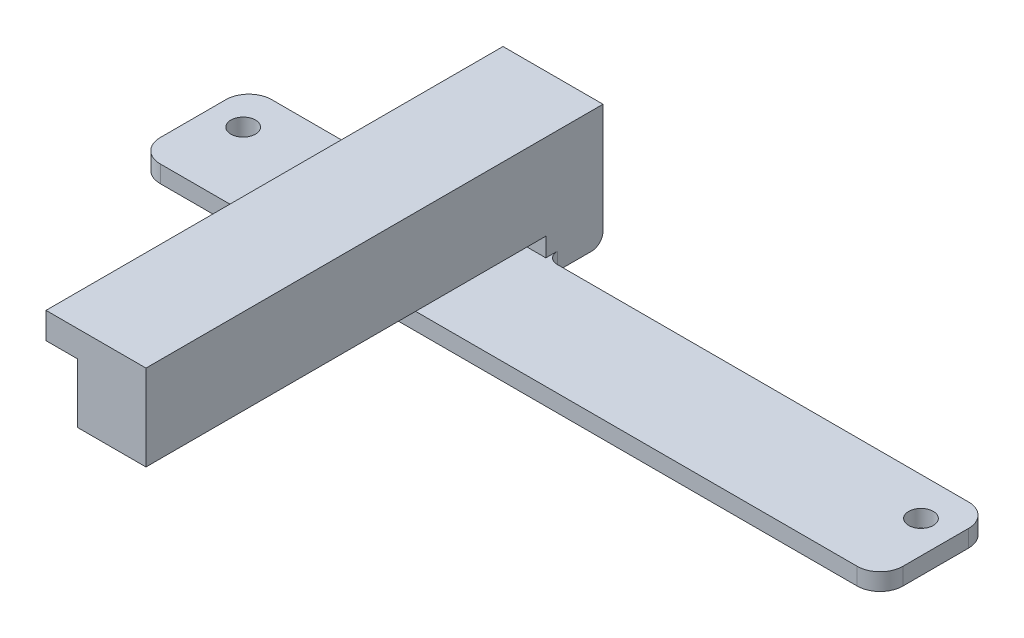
ISO-10303-21;
HEADER;
FILE_DESCRIPTION(('STEP AP214'),'2;1');
FILE_NAME('part.step','',(''),(''),'','','');
FILE_SCHEMA(('AUTOMOTIVE_DESIGN { 1 0 10303 214 1 1 1 1 }'));
ENDSEC;
DATA;
#1=APPLICATION_CONTEXT('core data for automotive mechanical design processes');
#2=APPLICATION_PROTOCOL_DEFINITION('international standard','automotive_design',2000,#1);
#3=PRODUCT_CONTEXT('',#1,'mechanical');
#4=PRODUCT('Part','Part','',(#3));
#5=PRODUCT_RELATED_PRODUCT_CATEGORY('part','',(#4));
#6=PRODUCT_DEFINITION_FORMATION('','',#4);
#7=PRODUCT_DEFINITION_CONTEXT('part definition',#1,'design');
#8=PRODUCT_DEFINITION('design','',#6,#7);
#9=PRODUCT_DEFINITION_SHAPE('','',#8);
#10=(LENGTH_UNIT() NAMED_UNIT(*) SI_UNIT(.MILLI.,.METRE.));
#11=(NAMED_UNIT(*) PLANE_ANGLE_UNIT() SI_UNIT($,.RADIAN.));
#12=(NAMED_UNIT(*) SI_UNIT($,.STERADIAN.) SOLID_ANGLE_UNIT());
#13=UNCERTAINTY_MEASURE_WITH_UNIT(LENGTH_MEASURE(1.E-05),#10,'distance_accuracy_value','');
#14=(GEOMETRIC_REPRESENTATION_CONTEXT(3) GLOBAL_UNCERTAINTY_ASSIGNED_CONTEXT((#13)) GLOBAL_UNIT_ASSIGNED_CONTEXT((#10,
#11,#12)) REPRESENTATION_CONTEXT('',''));
#15=CARTESIAN_POINT('',(0.,0.,0.));
#16=DIRECTION('',(0.,0.,1.));
#17=DIRECTION('',(1.,0.,0.));
#18=AXIS2_PLACEMENT_3D('',#15,#16,#17);
#19=CARTESIAN_POINT('',(-30.5,-20.1556443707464,-9.75));
#20=DIRECTION('',(0.,0.,1.));
#21=DIRECTION('',(1.,0.,0.));
#22=AXIS2_PLACEMENT_3D('',#19,#20,#21);
#23=PLANE('',#22);
#24=DIRECTION('',(0.,1.,0.));
#25=VECTOR('',#24,1.);
#26=CARTESIAN_POINT('',(-13.,-20.1556443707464,-9.75));
#27=LINE('',#26,#25);
#28=CARTESIAN_POINT('',(-13.,3.,-9.75));
#29=VERTEX_POINT('',#28);
#30=CARTESIAN_POINT('',(-13.,6.3,-9.75));
#31=VERTEX_POINT('',#30);
#32=EDGE_CURVE('E258',#29,#31,#27,.T.);
#33=ORIENTED_EDGE('',*,*,#32,.T.);
#34=DIRECTION('',(1.,0.,0.));
#35=VECTOR('',#34,1.);
#36=CARTESIAN_POINT('',(-13.,6.3,-9.75));
#37=LINE('',#36,#35);
#38=CARTESIAN_POINT('',(-25.,6.3,-9.75));
#39=VERTEX_POINT('',#38);
#40=EDGE_CURVE('E208',#39,#31,#37,.T.);
#41=ORIENTED_EDGE('',*,*,#40,.F.);
#42=DIRECTION('',(1.,0.,0.));
#43=VECTOR('',#42,1.);
#44=CARTESIAN_POINT('',(-30.5,6.3,-9.75));
#45=LINE('',#44,#43);
#46=CARTESIAN_POINT('',(-30.5,6.3,-9.75));
#47=VERTEX_POINT('',#46);
#48=EDGE_CURVE('E223',#47,#39,#45,.T.);
#49=ORIENTED_EDGE('',*,*,#48,.F.);
#50=DIRECTION('',(0.,1.,0.));
#51=VECTOR('',#50,1.);
#52=CARTESIAN_POINT('',(-30.5,-20.1556443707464,-9.75));
#53=LINE('',#52,#51);
#54=CARTESIAN_POINT('',(-30.5,3.,-9.75));
#55=VERTEX_POINT('',#54);
#56=EDGE_CURVE('E261',#55,#47,#53,.T.);
#57=ORIENTED_EDGE('',*,*,#56,.F.);
#58=DIRECTION('',(-1.,0.,0.));
#59=VECTOR('',#58,1.);
#60=CARTESIAN_POINT('',(0.,3.,-9.75));
#61=LINE('',#60,#59);
#62=EDGE_CURVE('E275',#29,#55,#61,.T.);
#63=ORIENTED_EDGE('',*,*,#62,.F.);
#64=EDGE_LOOP('',(#33,#41,#49,#57,#63));
#65=FACE_BOUND('',#64,.T.);
#66=ADVANCED_FACE('F39',(#65),#23,.T.);
#67=CARTESIAN_POINT('',(-30.5,-20.1556443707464,-9.75));
#68=DIRECTION('',(-1.,0.,0.));
#69=DIRECTION('',(0.,0.,1.));
#70=AXIS2_PLACEMENT_3D('',#67,#68,#69);
#71=PLANE('',#70);
#72=DIRECTION('',(0.,0.,1.));
#73=VECTOR('',#72,1.);
#74=CARTESIAN_POINT('',(-30.5,6.3,-31.5147779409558));
#75=LINE('',#74,#73);
#76=CARTESIAN_POINT('',(-30.5,6.3,-19.75));
#77=VERTEX_POINT('',#76);
#78=EDGE_CURVE('E191',#77,#47,#75,.T.);
#79=ORIENTED_EDGE('',*,*,#78,.F.);
#80=DIRECTION('',(0.,1.,0.));
#81=VECTOR('',#80,1.);
#82=CARTESIAN_POINT('',(-30.5,-20.1556443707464,-19.75));
#83=LINE('',#82,#81);
#84=CARTESIAN_POINT('',(-30.5,2.,-19.75));
#85=VERTEX_POINT('',#84);
#86=EDGE_CURVE('E262',#85,#77,#83,.T.);
#87=ORIENTED_EDGE('',*,*,#86,.F.);
#88=CARTESIAN_POINT('',(-30.5,2.,-17.75));
#89=DIRECTION('',(-1.,0.,0.));
#90=DIRECTION('',(0.,0.,1.));
#91=AXIS2_PLACEMENT_3D('',#88,#89,#90);
#92=CIRCLE('',#91,2.);
#93=CARTESIAN_POINT('',(-30.5,0.,-17.75));
#94=VERTEX_POINT('',#93);
#95=EDGE_CURVE('E344',#85,#94,#92,.T.);
#96=ORIENTED_EDGE('',*,*,#95,.T.);
#97=DIRECTION('',(0.,0.,1.));
#98=VECTOR('',#97,1.);
#99=CARTESIAN_POINT('',(-30.5,0.,-9.75));
#100=LINE('',#99,#98);
#101=CARTESIAN_POINT('',(-30.5,0.,-9.75));
#102=VERTEX_POINT('',#101);
#103=EDGE_CURVE('E259',#94,#102,#100,.T.);
#104=ORIENTED_EDGE('',*,*,#103,.T.);
#105=EDGE_CURVE('E272',#102,#55,#53,.T.);
#106=ORIENTED_EDGE('',*,*,#105,.T.);
#107=ORIENTED_EDGE('',*,*,#56,.T.);
#108=EDGE_LOOP('',(#79,#87,#96,#104,#106,#107));
#109=FACE_BOUND('',#108,.T.);
#110=ADVANCED_FACE('F407',(#109),#71,.T.);
#111=CARTESIAN_POINT('',(-65.,3.,-9.75));
#112=DIRECTION('',(0.,0.,1.));
#113=DIRECTION('',(1.,0.,0.));
#114=AXIS2_PLACEMENT_3D('',#111,#112,#113);
#115=PLANE('',#114);
#116=DIRECTION('',(-1.,0.,0.));
#117=VECTOR('',#116,1.);
#118=CARTESIAN_POINT('',(-65.,0.,-9.75));
#119=LINE('',#118,#117);
#120=CARTESIAN_POINT('',(61.,0.,-9.75));
#121=VERTEX_POINT('',#120);
#122=CARTESIAN_POINT('',(-11.,0.,-9.75));
#123=VERTEX_POINT('',#122);
#124=EDGE_CURVE('E296',#121,#123,#119,.T.);
#125=ORIENTED_EDGE('',*,*,#124,.T.);
#126=DIRECTION('',(0.,1.,0.));
#127=VECTOR('',#126,1.);
#128=CARTESIAN_POINT('',(-11.,3.,-9.75));
#129=LINE('',#128,#127);
#130=CARTESIAN_POINT('',(-11.,3.,-9.75));
#131=VERTEX_POINT('',#130);
#132=EDGE_CURVE('E353',#123,#131,#129,.T.);
#133=ORIENTED_EDGE('',*,*,#132,.T.);
#134=DIRECTION('',(-1.,0.,0.));
#135=VECTOR('',#134,1.);
#136=CARTESIAN_POINT('',(-65.,3.,-9.75));
#137=LINE('',#136,#135);
#138=CARTESIAN_POINT('',(61.,3.,-9.75));
#139=VERTEX_POINT('',#138);
#140=EDGE_CURVE('E283',#139,#131,#137,.T.);
#141=ORIENTED_EDGE('',*,*,#140,.F.);
#142=DIRECTION('',(0.,-1.,0.));
#143=VECTOR('',#142,1.);
#144=CARTESIAN_POINT('',(61.,3.,-9.75));
#145=LINE('',#144,#143);
#146=EDGE_CURVE('E335',#139,#121,#145,.T.);
#147=ORIENTED_EDGE('',*,*,#146,.T.);
#148=EDGE_LOOP('',(#125,#133,#141,#147));
#149=FACE_BOUND('',#148,.T.);
#150=ADVANCED_FACE('F366',(#149),#115,.F.);
#151=CARTESIAN_POINT('',(65.,3.,9.75));
#152=DIRECTION('',(-1.,0.,0.));
#153=DIRECTION('',(0.,0.,1.));
#154=AXIS2_PLACEMENT_3D('',#151,#152,#153);
#155=PLANE('',#154);
#156=DIRECTION('',(0.,0.,-1.));
#157=VECTOR('',#156,1.);
#158=CARTESIAN_POINT('',(65.,3.,9.75));
#159=LINE('',#158,#157);
#160=CARTESIAN_POINT('',(65.,3.,5.75));
#161=VERTEX_POINT('',#160);
#162=CARTESIAN_POINT('',(65.,3.,-5.75));
#163=VERTEX_POINT('',#162);
#164=EDGE_CURVE('E278',#161,#163,#159,.T.);
#165=ORIENTED_EDGE('',*,*,#164,.F.);
#166=DIRECTION('',(0.,-1.,0.));
#167=VECTOR('',#166,1.);
#168=CARTESIAN_POINT('',(65.,3.,5.75));
#169=LINE('',#168,#167);
#170=CARTESIAN_POINT('',(65.,0.,5.75));
#171=VERTEX_POINT('',#170);
#172=EDGE_CURVE('E305',#161,#171,#169,.T.);
#173=ORIENTED_EDGE('',*,*,#172,.T.);
#174=DIRECTION('',(0.,0.,-1.));
#175=VECTOR('',#174,1.);
#176=CARTESIAN_POINT('',(65.,0.,9.75));
#177=LINE('',#176,#175);
#178=CARTESIAN_POINT('',(65.,0.,-5.75));
#179=VERTEX_POINT('',#178);
#180=EDGE_CURVE('E277',#171,#179,#177,.T.);
#181=ORIENTED_EDGE('',*,*,#180,.T.);
#182=DIRECTION('',(0.,-1.,0.));
#183=VECTOR('',#182,1.);
#184=CARTESIAN_POINT('',(65.,3.,-5.75));
#185=LINE('',#184,#183);
#186=EDGE_CURVE('E292',#179,#163,#185,.F.);
#187=ORIENTED_EDGE('',*,*,#186,.T.);
#188=EDGE_LOOP('',(#165,#173,#181,#187));
#189=FACE_BOUND('',#188,.T.);
#190=ADVANCED_FACE('F375',(#189),#155,.F.);
#191=CARTESIAN_POINT('',(-61.,3.,-9.75));
#192=VERTEX_POINT('',#191);
#193=EDGE_CURVE('E281',#55,#192,#137,.T.);
#194=ORIENTED_EDGE('',*,*,#193,.F.);
#195=ORIENTED_EDGE('',*,*,#105,.F.);
#196=CARTESIAN_POINT('',(-61.,0.,-9.75));
#197=VERTEX_POINT('',#196);
#198=EDGE_CURVE('E295',#102,#197,#119,.T.);
#199=ORIENTED_EDGE('',*,*,#198,.T.);
#200=DIRECTION('',(0.,-1.,0.));
#201=VECTOR('',#200,1.);
#202=CARTESIAN_POINT('',(-61.,3.,-9.75));
#203=LINE('',#202,#201);
#204=EDGE_CURVE('E338',#197,#192,#203,.F.);
#205=ORIENTED_EDGE('',*,*,#204,.T.);
#206=EDGE_LOOP('',(#194,#195,#199,#205));
#207=FACE_BOUND('',#206,.T.);
#208=ADVANCED_FACE('F403',(#207),#115,.F.);
#209=CARTESIAN_POINT('',(-65.,3.,9.75));
#210=DIRECTION('',(1.,0.,0.));
#211=DIRECTION('',(0.,0.,-1.));
#212=AXIS2_PLACEMENT_3D('',#209,#210,#211);
#213=PLANE('',#212);
#214=DIRECTION('',(0.,0.,1.));
#215=VECTOR('',#214,1.);
#216=CARTESIAN_POINT('',(-65.,0.,9.75));
#217=LINE('',#216,#215);
#218=CARTESIAN_POINT('',(-65.,0.,-5.75));
#219=VERTEX_POINT('',#218);
#220=CARTESIAN_POINT('',(-65.,0.,5.75));
#221=VERTEX_POINT('',#220);
#222=EDGE_CURVE('E299',#219,#221,#217,.T.);
#223=ORIENTED_EDGE('',*,*,#222,.T.);
#224=DIRECTION('',(0.,-1.,0.));
#225=VECTOR('',#224,1.);
#226=CARTESIAN_POINT('',(-65.,3.,5.75));
#227=LINE('',#226,#225);
#228=CARTESIAN_POINT('',(-65.,3.,5.75));
#229=VERTEX_POINT('',#228);
#230=EDGE_CURVE('E333',#221,#229,#227,.F.);
#231=ORIENTED_EDGE('',*,*,#230,.T.);
#232=DIRECTION('',(0.,0.,1.));
#233=VECTOR('',#232,1.);
#234=CARTESIAN_POINT('',(-65.,3.,9.75));
#235=LINE('',#234,#233);
#236=CARTESIAN_POINT('',(-65.,3.,-5.75));
#237=VERTEX_POINT('',#236);
#238=EDGE_CURVE('E286',#237,#229,#235,.T.);
#239=ORIENTED_EDGE('',*,*,#238,.F.);
#240=DIRECTION('',(0.,-1.,0.));
#241=VECTOR('',#240,1.);
#242=CARTESIAN_POINT('',(-65.,3.,-5.75));
#243=LINE('',#242,#241);
#244=EDGE_CURVE('E330',#237,#219,#243,.T.);
#245=ORIENTED_EDGE('',*,*,#244,.T.);
#246=EDGE_LOOP('',(#223,#231,#239,#245));
#247=FACE_BOUND('',#246,.T.);
#248=ADVANCED_FACE('F392',(#247),#213,.F.);
#249=CARTESIAN_POINT('',(-65.,3.,9.75));
#250=DIRECTION('',(0.,0.,-1.));
#251=DIRECTION('',(-1.,0.,0.));
#252=AXIS2_PLACEMENT_3D('',#249,#250,#251);
#253=PLANE('',#252);
#254=DIRECTION('',(1.,0.,0.));
#255=VECTOR('',#254,1.);
#256=CARTESIAN_POINT('',(-65.,0.,9.75));
#257=LINE('',#256,#255);
#258=CARTESIAN_POINT('',(-61.,0.,9.75));
#259=VERTEX_POINT('',#258);
#260=CARTESIAN_POINT('',(61.,0.,9.75));
#261=VERTEX_POINT('',#260);
#262=EDGE_CURVE('E282',#259,#261,#257,.T.);
#263=ORIENTED_EDGE('',*,*,#262,.T.);
#264=DIRECTION('',(0.,-1.,0.));
#265=VECTOR('',#264,1.);
#266=CARTESIAN_POINT('',(61.,3.,9.75));
#267=LINE('',#266,#265);
#268=CARTESIAN_POINT('',(61.,3.,9.75));
#269=VERTEX_POINT('',#268);
#270=EDGE_CURVE('E320',#261,#269,#267,.F.);
#271=ORIENTED_EDGE('',*,*,#270,.T.);
#272=DIRECTION('',(1.,0.,0.));
#273=VECTOR('',#272,1.);
#274=CARTESIAN_POINT('',(-65.,3.,9.75));
#275=LINE('',#274,#273);
#276=CARTESIAN_POINT('',(-61.,3.,9.75));
#277=VERTEX_POINT('',#276);
#278=EDGE_CURVE('E289',#277,#269,#275,.T.);
#279=ORIENTED_EDGE('',*,*,#278,.F.);
#280=DIRECTION('',(0.,-1.,0.));
#281=VECTOR('',#280,1.);
#282=CARTESIAN_POINT('',(-61.,3.,9.75));
#283=LINE('',#282,#281);
#284=EDGE_CURVE('E317',#277,#259,#283,.T.);
#285=ORIENTED_EDGE('',*,*,#284,.T.);
#286=EDGE_LOOP('',(#263,#271,#279,#285));
#287=FACE_BOUND('',#286,.T.);
#288=ADVANCED_FACE('F383',(#287),#253,.F.);
#289=CARTESIAN_POINT('',(0.,3.,0.));
#290=DIRECTION('',(0.,-1.,0.));
#291=DIRECTION('',(0.,0.,-1.));
#292=AXIS2_PLACEMENT_3D('',#289,#290,#291);
#293=PLANE('',#292);
#294=CARTESIAN_POINT('',(-59.325,3.,-3.09));
#295=DIRECTION('',(0.,-1.,0.));
#296=DIRECTION('',(0.,0.,-1.));
#297=AXIS2_PLACEMENT_3D('',#294,#295,#296);
#298=CIRCLE('',#297,2.15);
#299=CARTESIAN_POINT('',(-59.325,3.,-5.24));
#300=VERTEX_POINT('',#299);
#301=EDGE_CURVE('E242',#300,#300,#298,.F.);
#302=ORIENTED_EDGE('',*,*,#301,.F.);
#303=EDGE_LOOP('',(#302));
#304=FACE_BOUND('',#303,.T.);
#305=CARTESIAN_POINT('',(59.325,3.,-3.08999999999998));
#306=DIRECTION('',(0.,-1.,0.));
#307=DIRECTION('',(0.,0.,-1.));
#308=AXIS2_PLACEMENT_3D('',#305,#306,#307);
#309=CIRCLE('',#308,2.15);
#310=CARTESIAN_POINT('',(59.325,3.,-5.23999999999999));
#311=VERTEX_POINT('',#310);
#312=EDGE_CURVE('E238',#311,#311,#309,.F.);
#313=ORIENTED_EDGE('',*,*,#312,.F.);
#314=EDGE_LOOP('',(#313));
#315=FACE_BOUND('',#314,.T.);
#316=ORIENTED_EDGE('',*,*,#278,.T.);
#317=CARTESIAN_POINT('',(61.,3.,5.75));
#318=DIRECTION('',(0.,-1.,0.));
#319=DIRECTION('',(0.,0.,-1.));
#320=AXIS2_PLACEMENT_3D('',#317,#318,#319);
#321=CIRCLE('',#320,4.);
#322=EDGE_CURVE('E328',#269,#161,#321,.F.);
#323=ORIENTED_EDGE('',*,*,#322,.T.);
#324=ORIENTED_EDGE('',*,*,#164,.T.);
#325=CARTESIAN_POINT('',(61.,3.,-5.75));
#326=DIRECTION('',(0.,-1.,0.));
#327=DIRECTION('',(0.,0.,-1.));
#328=AXIS2_PLACEMENT_3D('',#325,#326,#327);
#329=CIRCLE('',#328,4.);
#330=EDGE_CURVE('E322',#163,#139,#329,.F.);
#331=ORIENTED_EDGE('',*,*,#330,.T.);
#332=ORIENTED_EDGE('',*,*,#140,.T.);
#333=CARTESIAN_POINT('',(-11.,3.,-11.75));
#334=DIRECTION('',(0.,-1.,0.));
#335=DIRECTION('',(0.,0.,-1.));
#336=AXIS2_PLACEMENT_3D('',#333,#334,#335);
#337=CIRCLE('',#336,2.);
#338=CARTESIAN_POINT('',(-13.,3.,-11.75));
#339=VERTEX_POINT('',#338);
#340=EDGE_CURVE('E47',#131,#339,#337,.T.);
#341=ORIENTED_EDGE('',*,*,#340,.T.);
#342=DIRECTION('',(0.,0.,-1.));
#343=VECTOR('',#342,1.);
#344=CARTESIAN_POINT('',(-13.,3.,-9.75));
#345=LINE('',#344,#343);
#346=EDGE_CURVE('E54',#29,#339,#345,.T.);
#347=ORIENTED_EDGE('',*,*,#346,.F.);
#348=ORIENTED_EDGE('',*,*,#62,.T.);
#349=ORIENTED_EDGE('',*,*,#193,.T.);
#350=CARTESIAN_POINT('',(-61.,3.,-5.75));
#351=DIRECTION('',(0.,-1.,0.));
#352=DIRECTION('',(0.,0.,-1.));
#353=AXIS2_PLACEMENT_3D('',#350,#351,#352);
#354=CIRCLE('',#353,4.);
#355=EDGE_CURVE('E324',#192,#237,#354,.F.);
#356=ORIENTED_EDGE('',*,*,#355,.T.);
#357=ORIENTED_EDGE('',*,*,#238,.T.);
#358=CARTESIAN_POINT('',(-61.,3.,5.75));
#359=DIRECTION('',(0.,-1.,0.));
#360=DIRECTION('',(0.,0.,-1.));
#361=AXIS2_PLACEMENT_3D('',#358,#359,#360);
#362=CIRCLE('',#361,4.);
#363=EDGE_CURVE('E326',#229,#277,#362,.F.);
#364=ORIENTED_EDGE('',*,*,#363,.T.);
#365=EDGE_LOOP('',(#316,#323,#324,#331,#332,#341,#347,#348,#349,#356,#357,#364));
#366=FACE_BOUND('',#365,.T.);
#367=ADVANCED_FACE('F354',(#304,#315,#366),#293,.F.);
#368=CARTESIAN_POINT('',(0.,0.,0.));
#369=DIRECTION('',(0.,-1.,0.));
#370=DIRECTION('',(0.,0.,-1.));
#371=AXIS2_PLACEMENT_3D('',#368,#369,#370);
#372=PLANE('',#371);
#373=CARTESIAN_POINT('',(-59.325,0.,-3.09));
#374=DIRECTION('',(0.,-1.,0.));
#375=DIRECTION('',(0.,0.,-1.));
#376=AXIS2_PLACEMENT_3D('',#373,#374,#375);
#377=CIRCLE('',#376,2.15);
#378=CARTESIAN_POINT('',(-59.325,0.,-5.24));
#379=VERTEX_POINT('',#378);
#380=EDGE_CURVE('E239',#379,#379,#377,.T.);
#381=ORIENTED_EDGE('',*,*,#380,.F.);
#382=EDGE_LOOP('',(#381));
#383=FACE_BOUND('',#382,.T.);
#384=CARTESIAN_POINT('',(59.325,0.,-3.08999999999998));
#385=DIRECTION('',(0.,-1.,0.));
#386=DIRECTION('',(0.,0.,1.));
#387=AXIS2_PLACEMENT_3D('',#384,#385,#386);
#388=CIRCLE('',#387,2.15);
#389=CARTESIAN_POINT('',(59.325,0.,-0.939999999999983));
#390=VERTEX_POINT('',#389);
#391=EDGE_CURVE('E243',#390,#390,#388,.T.);
#392=ORIENTED_EDGE('',*,*,#391,.F.);
#393=EDGE_LOOP('',(#392));
#394=FACE_BOUND('',#393,.T.);
#395=ORIENTED_EDGE('',*,*,#103,.F.);
#396=DIRECTION('',(-1.,0.,0.));
#397=VECTOR('',#396,1.);
#398=CARTESIAN_POINT('',(0.,0.,-17.75));
#399=LINE('',#398,#397);
#400=CARTESIAN_POINT('',(-13.,0.,-17.75));
#401=VERTEX_POINT('',#400);
#402=EDGE_CURVE('E346',#94,#401,#399,.F.);
#403=ORIENTED_EDGE('',*,*,#402,.T.);
#404=DIRECTION('',(0.,0.,-1.));
#405=VECTOR('',#404,1.);
#406=CARTESIAN_POINT('',(-13.,0.,-9.75));
#407=LINE('',#406,#405);
#408=CARTESIAN_POINT('',(-13.,0.,-11.75));
#409=VERTEX_POINT('',#408);
#410=EDGE_CURVE('E263',#409,#401,#407,.T.);
#411=ORIENTED_EDGE('',*,*,#410,.F.);
#412=CARTESIAN_POINT('',(-11.,0.,-11.75));
#413=DIRECTION('',(0.,-1.,0.));
#414=DIRECTION('',(0.,0.,-1.));
#415=AXIS2_PLACEMENT_3D('',#412,#413,#414);
#416=CIRCLE('',#415,2.);
#417=EDGE_CURVE('E11',#409,#123,#416,.F.);
#418=ORIENTED_EDGE('',*,*,#417,.T.);
#419=ORIENTED_EDGE('',*,*,#124,.F.);
#420=CARTESIAN_POINT('',(61.,0.,-5.75));
#421=DIRECTION('',(0.,-1.,0.));
#422=DIRECTION('',(0.,0.,-1.));
#423=AXIS2_PLACEMENT_3D('',#420,#421,#422);
#424=CIRCLE('',#423,4.);
#425=EDGE_CURVE('E308',#121,#179,#424,.T.);
#426=ORIENTED_EDGE('',*,*,#425,.T.);
#427=ORIENTED_EDGE('',*,*,#180,.F.);
#428=CARTESIAN_POINT('',(61.,0.,5.75));
#429=DIRECTION('',(0.,-1.,0.));
#430=DIRECTION('',(0.,0.,-1.));
#431=AXIS2_PLACEMENT_3D('',#428,#429,#430);
#432=CIRCLE('',#431,4.);
#433=EDGE_CURVE('E315',#171,#261,#432,.T.);
#434=ORIENTED_EDGE('',*,*,#433,.T.);
#435=ORIENTED_EDGE('',*,*,#262,.F.);
#436=CARTESIAN_POINT('',(-61.,0.,5.75));
#437=DIRECTION('',(0.,-1.,0.));
#438=DIRECTION('',(0.,0.,-1.));
#439=AXIS2_PLACEMENT_3D('',#436,#437,#438);
#440=CIRCLE('',#439,4.);
#441=EDGE_CURVE('E313',#259,#221,#440,.T.);
#442=ORIENTED_EDGE('',*,*,#441,.T.);
#443=ORIENTED_EDGE('',*,*,#222,.F.);
#444=CARTESIAN_POINT('',(-61.,0.,-5.75));
#445=DIRECTION('',(0.,-1.,0.));
#446=DIRECTION('',(0.,0.,-1.));
#447=AXIS2_PLACEMENT_3D('',#444,#445,#446);
#448=CIRCLE('',#447,4.);
#449=EDGE_CURVE('E310',#219,#197,#448,.T.);
#450=ORIENTED_EDGE('',*,*,#449,.T.);
#451=ORIENTED_EDGE('',*,*,#198,.F.);
#452=EDGE_LOOP('',(#395,#403,#411,#418,#419,#426,#427,#434,#435,#442,#443,#450,#451));
#453=FACE_BOUND('',#452,.T.);
#454=ADVANCED_FACE('F364',(#383,#394,#453),#372,.T.);
#455=CARTESIAN_POINT('',(61.,3.,5.75));
#456=DIRECTION('',(0.,-1.,0.));
#457=DIRECTION('',(0.,0.,-1.));
#458=AXIS2_PLACEMENT_3D('',#455,#456,#457);
#459=CYLINDRICAL_SURFACE('',#458,4.);
#460=ORIENTED_EDGE('',*,*,#322,.F.);
#461=ORIENTED_EDGE('',*,*,#270,.F.);
#462=ORIENTED_EDGE('',*,*,#433,.F.);
#463=ORIENTED_EDGE('',*,*,#172,.F.);
#464=EDGE_LOOP('',(#460,#461,#462,#463));
#465=FACE_BOUND('',#464,.T.);
#466=ADVANCED_FACE('F379',(#465),#459,.T.);
#467=CARTESIAN_POINT('',(-61.,3.,5.75));
#468=DIRECTION('',(0.,-1.,0.));
#469=DIRECTION('',(0.,0.,-1.));
#470=AXIS2_PLACEMENT_3D('',#467,#468,#469);
#471=CYLINDRICAL_SURFACE('',#470,4.);
#472=ORIENTED_EDGE('',*,*,#363,.F.);
#473=ORIENTED_EDGE('',*,*,#230,.F.);
#474=ORIENTED_EDGE('',*,*,#441,.F.);
#475=ORIENTED_EDGE('',*,*,#284,.F.);
#476=EDGE_LOOP('',(#472,#473,#474,#475));
#477=FACE_BOUND('',#476,.T.);
#478=ADVANCED_FACE('F388',(#477),#471,.T.);
#479=CARTESIAN_POINT('',(-61.,3.,-5.75));
#480=DIRECTION('',(0.,-1.,0.));
#481=DIRECTION('',(0.,0.,-1.));
#482=AXIS2_PLACEMENT_3D('',#479,#480,#481);
#483=CYLINDRICAL_SURFACE('',#482,4.);
#484=ORIENTED_EDGE('',*,*,#355,.F.);
#485=ORIENTED_EDGE('',*,*,#204,.F.);
#486=ORIENTED_EDGE('',*,*,#449,.F.);
#487=ORIENTED_EDGE('',*,*,#244,.F.);
#488=EDGE_LOOP('',(#484,#485,#486,#487));
#489=FACE_BOUND('',#488,.T.);
#490=ADVANCED_FACE('F397',(#489),#483,.T.);
#491=CARTESIAN_POINT('',(61.,3.,-5.75));
#492=DIRECTION('',(0.,-1.,0.));
#493=DIRECTION('',(0.,0.,-1.));
#494=AXIS2_PLACEMENT_3D('',#491,#492,#493);
#495=CYLINDRICAL_SURFACE('',#494,4.);
#496=ORIENTED_EDGE('',*,*,#330,.F.);
#497=ORIENTED_EDGE('',*,*,#186,.F.);
#498=ORIENTED_EDGE('',*,*,#425,.F.);
#499=ORIENTED_EDGE('',*,*,#146,.F.);
#500=EDGE_LOOP('',(#496,#497,#498,#499));
#501=FACE_BOUND('',#500,.T.);
#502=ADVANCED_FACE('F370',(#501),#495,.T.);
#503=CARTESIAN_POINT('',(-13.,-20.1556443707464,-9.75));
#504=DIRECTION('',(1.,0.,0.));
#505=DIRECTION('',(0.,0.,-1.));
#506=AXIS2_PLACEMENT_3D('',#503,#504,#505);
#507=PLANE('',#506);
#508=ORIENTED_EDGE('',*,*,#410,.T.);
#509=CARTESIAN_POINT('',(-13.,2.,-17.75));
#510=DIRECTION('',(1.,0.,0.));
#511=DIRECTION('',(0.,0.,-1.));
#512=AXIS2_PLACEMENT_3D('',#509,#510,#511);
#513=CIRCLE('',#512,2.);
#514=CARTESIAN_POINT('',(-13.,2.,-19.75));
#515=VERTEX_POINT('',#514);
#516=EDGE_CURVE('E351',#401,#515,#513,.T.);
#517=ORIENTED_EDGE('',*,*,#516,.T.);
#518=DIRECTION('',(0.,1.,0.));
#519=VECTOR('',#518,1.);
#520=CARTESIAN_POINT('',(-13.,-20.1556443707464,-19.75));
#521=LINE('',#520,#519);
#522=CARTESIAN_POINT('',(-13.,21.3,-19.75));
#523=VERTEX_POINT('',#522);
#524=EDGE_CURVE('E266',#515,#523,#521,.T.);
#525=ORIENTED_EDGE('',*,*,#524,.T.);
#526=DIRECTION('',(0.,0.,-1.));
#527=VECTOR('',#526,1.);
#528=CARTESIAN_POINT('',(-13.,21.3,-9.75));
#529=LINE('',#528,#527);
#530=CARTESIAN_POINT('',(-13.,21.3,60.25));
#531=VERTEX_POINT('',#530);
#532=EDGE_CURVE('E252',#531,#523,#529,.T.);
#533=ORIENTED_EDGE('',*,*,#532,.F.);
#534=DIRECTION('',(0.,1.,0.));
#535=VECTOR('',#534,1.);
#536=CARTESIAN_POINT('',(-13.,21.3,60.25));
#537=LINE('',#536,#535);
#538=CARTESIAN_POINT('',(-13.,6.3,60.25));
#539=VERTEX_POINT('',#538);
#540=EDGE_CURVE('E215',#539,#531,#537,.T.);
#541=ORIENTED_EDGE('',*,*,#540,.F.);
#542=DIRECTION('',(0.,0.,-1.));
#543=VECTOR('',#542,1.);
#544=CARTESIAN_POINT('',(-13.,6.3,60.25));
#545=LINE('',#544,#543);
#546=EDGE_CURVE('E217',#539,#31,#545,.T.);
#547=ORIENTED_EDGE('',*,*,#546,.T.);
#548=ORIENTED_EDGE('',*,*,#32,.F.);
#549=ORIENTED_EDGE('',*,*,#346,.T.);
#550=DIRECTION('',(0.,1.,0.));
#551=VECTOR('',#550,1.);
#552=CARTESIAN_POINT('',(-13.,-20.1556443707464,-11.75));
#553=LINE('',#552,#551);
#554=EDGE_CURVE('E348',#339,#409,#553,.F.);
#555=ORIENTED_EDGE('',*,*,#554,.T.);
#556=EDGE_LOOP('',(#508,#517,#525,#533,#541,#547,#548,#549,#555));
#557=FACE_BOUND('',#556,.T.);
#558=ADVANCED_FACE('F357',(#557),#507,.T.);
#559=CARTESIAN_POINT('',(-30.5,-20.1556443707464,-19.75));
#560=DIRECTION('',(0.,0.,-1.));
#561=DIRECTION('',(-1.,0.,0.));
#562=AXIS2_PLACEMENT_3D('',#559,#560,#561);
#563=PLANE('',#562);
#564=DIRECTION('',(1.,0.,0.));
#565=VECTOR('',#564,1.);
#566=CARTESIAN_POINT('',(-30.5,6.3,-19.75));
#567=LINE('',#566,#565);
#568=CARTESIAN_POINT('',(-25.,6.3,-19.75));
#569=VERTEX_POINT('',#568);
#570=EDGE_CURVE('E226',#77,#569,#567,.T.);
#571=ORIENTED_EDGE('',*,*,#570,.T.);
#572=DIRECTION('',(0.,1.,0.));
#573=VECTOR('',#572,1.);
#574=CARTESIAN_POINT('',(-25.,16.7,-19.75));
#575=LINE('',#574,#573);
#576=CARTESIAN_POINT('',(-25.,16.7,-19.75));
#577=VERTEX_POINT('',#576);
#578=EDGE_CURVE('E231',#569,#577,#575,.T.);
#579=ORIENTED_EDGE('',*,*,#578,.T.);
#580=DIRECTION('',(-1.,0.,0.));
#581=VECTOR('',#580,1.);
#582=CARTESIAN_POINT('',(-30.5,16.7,-19.75));
#583=LINE('',#582,#581);
#584=CARTESIAN_POINT('',(-30.5,16.7,-19.75));
#585=VERTEX_POINT('',#584);
#586=EDGE_CURVE('E192',#577,#585,#583,.T.);
#587=ORIENTED_EDGE('',*,*,#586,.T.);
#588=CARTESIAN_POINT('',(-30.5,21.3,-19.75));
#589=VERTEX_POINT('',#588);
#590=EDGE_CURVE('E188',#585,#589,#83,.T.);
#591=ORIENTED_EDGE('',*,*,#590,.T.);
#592=DIRECTION('',(-1.,0.,0.));
#593=VECTOR('',#592,1.);
#594=CARTESIAN_POINT('',(-30.5,21.3,-19.75));
#595=LINE('',#594,#593);
#596=EDGE_CURVE('E255',#523,#589,#595,.T.);
#597=ORIENTED_EDGE('',*,*,#596,.F.);
#598=ORIENTED_EDGE('',*,*,#524,.F.);
#599=DIRECTION('',(-1.,0.,0.));
#600=VECTOR('',#599,1.);
#601=CARTESIAN_POINT('',(-30.5,2.,-19.75));
#602=LINE('',#601,#600);
#603=EDGE_CURVE('E341',#515,#85,#602,.T.);
#604=ORIENTED_EDGE('',*,*,#603,.T.);
#605=ORIENTED_EDGE('',*,*,#86,.T.);
#606=EDGE_LOOP('',(#571,#579,#587,#591,#597,#598,#604,#605));
#607=FACE_BOUND('',#606,.T.);
#608=ADVANCED_FACE('F416',(#607),#563,.T.);
#609=DIRECTION('',(0.,0.,1.));
#610=VECTOR('',#609,1.);
#611=CARTESIAN_POINT('',(-30.5,16.7,-31.5147779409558));
#612=LINE('',#611,#610);
#613=CARTESIAN_POINT('',(-30.5,16.7,60.25));
#614=VERTEX_POINT('',#613);
#615=EDGE_CURVE('E182',#585,#614,#612,.T.);
#616=ORIENTED_EDGE('',*,*,#615,.T.);
#617=DIRECTION('',(0.,-1.,0.));
#618=VECTOR('',#617,1.);
#619=CARTESIAN_POINT('',(-30.5,16.7,60.25));
#620=LINE('',#619,#618);
#621=CARTESIAN_POINT('',(-30.5,21.3,60.25));
#622=VERTEX_POINT('',#621);
#623=EDGE_CURVE('E187',#622,#614,#620,.T.);
#624=ORIENTED_EDGE('',*,*,#623,.F.);
#625=DIRECTION('',(0.,0.,1.));
#626=VECTOR('',#625,1.);
#627=CARTESIAN_POINT('',(-30.5,21.3,-9.75));
#628=LINE('',#627,#626);
#629=EDGE_CURVE('E246',#589,#622,#628,.T.);
#630=ORIENTED_EDGE('',*,*,#629,.F.);
#631=ORIENTED_EDGE('',*,*,#590,.F.);
#632=EDGE_LOOP('',(#616,#624,#630,#631));
#633=FACE_BOUND('',#632,.T.);
#634=ADVANCED_FACE('F184',(#633),#71,.T.);
#635=CARTESIAN_POINT('',(0.,21.3,0.));
#636=DIRECTION('',(0.,-1.,0.));
#637=DIRECTION('',(0.,0.,-1.));
#638=AXIS2_PLACEMENT_3D('',#635,#636,#637);
#639=PLANE('',#638);
#640=ORIENTED_EDGE('',*,*,#629,.T.);
#641=DIRECTION('',(-1.,0.,0.));
#642=VECTOR('',#641,1.);
#643=CARTESIAN_POINT('',(-30.5,21.3,60.25));
#644=LINE('',#643,#642);
#645=EDGE_CURVE('E207',#531,#622,#644,.T.);
#646=ORIENTED_EDGE('',*,*,#645,.F.);
#647=ORIENTED_EDGE('',*,*,#532,.T.);
#648=ORIENTED_EDGE('',*,*,#596,.T.);
#649=EDGE_LOOP('',(#640,#646,#647,#648));
#650=FACE_BOUND('',#649,.T.);
#651=ADVANCED_FACE('F420',(#650),#639,.F.);
#652=CARTESIAN_POINT('',(-30.5,2.,-17.75));
#653=DIRECTION('',(-1.,0.,0.));
#654=DIRECTION('',(0.,0.,1.));
#655=AXIS2_PLACEMENT_3D('',#652,#653,#654);
#656=CYLINDRICAL_SURFACE('',#655,2.);
#657=ORIENTED_EDGE('',*,*,#516,.F.);
#658=ORIENTED_EDGE('',*,*,#402,.F.);
#659=ORIENTED_EDGE('',*,*,#95,.F.);
#660=ORIENTED_EDGE('',*,*,#603,.F.);
#661=EDGE_LOOP('',(#657,#658,#659,#660));
#662=FACE_BOUND('',#661,.T.);
#663=ADVANCED_FACE('F413',(#662),#656,.T.);
#664=CARTESIAN_POINT('',(-11.,3.,-11.75));
#665=DIRECTION('',(0.,1.,0.));
#666=DIRECTION('',(0.,0.,1.));
#667=AXIS2_PLACEMENT_3D('',#664,#665,#666);
#668=CYLINDRICAL_SURFACE('',#667,2.);
#669=ORIENTED_EDGE('',*,*,#417,.F.);
#670=ORIENTED_EDGE('',*,*,#554,.F.);
#671=ORIENTED_EDGE('',*,*,#340,.F.);
#672=ORIENTED_EDGE('',*,*,#132,.F.);
#673=EDGE_LOOP('',(#669,#670,#671,#672));
#674=FACE_BOUND('',#673,.T.);
#675=ADVANCED_FACE('F41',(#674),#668,.F.);
#676=CARTESIAN_POINT('',(59.325,9.08111831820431,-3.08999999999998));
#677=DIRECTION('',(0.,-1.,0.));
#678=DIRECTION('',(0.,0.,-1.));
#679=AXIS2_PLACEMENT_3D('',#676,#677,#678);
#680=CYLINDRICAL_SURFACE('',#679,2.15);
#681=ORIENTED_EDGE('',*,*,#312,.T.);
#682=EDGE_LOOP('',(#681));
#683=FACE_BOUND('',#682,.T.);
#684=ORIENTED_EDGE('',*,*,#391,.T.);
#685=EDGE_LOOP('',(#684));
#686=FACE_BOUND('',#685,.T.);
#687=ADVANCED_FACE('F565',(#683,#686),#680,.F.);
#688=CARTESIAN_POINT('',(-59.325,9.08111831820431,-3.09));
#689=DIRECTION('',(0.,-1.,0.));
#690=DIRECTION('',(0.,0.,-1.));
#691=AXIS2_PLACEMENT_3D('',#688,#689,#690);
#692=CYLINDRICAL_SURFACE('',#691,2.15);
#693=ORIENTED_EDGE('',*,*,#301,.T.);
#694=EDGE_LOOP('',(#693));
#695=FACE_BOUND('',#694,.T.);
#696=ORIENTED_EDGE('',*,*,#380,.T.);
#697=EDGE_LOOP('',(#696));
#698=FACE_BOUND('',#697,.T.);
#699=ADVANCED_FACE('F492',(#695,#698),#692,.F.);
#700=CARTESIAN_POINT('',(-30.5,6.3,-31.5147779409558));
#701=DIRECTION('',(0.,-1.,0.));
#702=DIRECTION('',(0.,0.,-1.));
#703=AXIS2_PLACEMENT_3D('',#700,#701,#702);
#704=PLANE('',#703);
#705=ORIENTED_EDGE('',*,*,#78,.T.);
#706=ORIENTED_EDGE('',*,*,#48,.T.);
#707=DIRECTION('',(0.,0.,1.));
#708=VECTOR('',#707,1.);
#709=CARTESIAN_POINT('',(-25.,6.3,-31.5147779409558));
#710=LINE('',#709,#708);
#711=EDGE_CURVE('E229',#569,#39,#710,.T.);
#712=ORIENTED_EDGE('',*,*,#711,.F.);
#713=ORIENTED_EDGE('',*,*,#570,.F.);
#714=EDGE_LOOP('',(#705,#706,#712,#713));
#715=FACE_BOUND('',#714,.T.);
#716=ADVANCED_FACE('F486',(#715),#704,.F.);
#717=CARTESIAN_POINT('',(-25.,16.7,-31.5147779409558));
#718=DIRECTION('',(1.,0.,0.));
#719=DIRECTION('',(0.,0.,-1.));
#720=AXIS2_PLACEMENT_3D('',#717,#718,#719);
#721=PLANE('',#720);
#722=ORIENTED_EDGE('',*,*,#711,.T.);
#723=DIRECTION('',(0.,0.,-1.));
#724=VECTOR('',#723,1.);
#725=CARTESIAN_POINT('',(-25.,6.3,60.25));
#726=LINE('',#725,#724);
#727=CARTESIAN_POINT('',(-25.,6.3,60.25));
#728=VERTEX_POINT('',#727);
#729=EDGE_CURVE('E221',#728,#39,#726,.T.);
#730=ORIENTED_EDGE('',*,*,#729,.F.);
#731=DIRECTION('',(0.,-1.,0.));
#732=VECTOR('',#731,1.);
#733=CARTESIAN_POINT('',(-25.,6.3,60.25));
#734=LINE('',#733,#732);
#735=CARTESIAN_POINT('',(-25.,16.7,60.25));
#736=VERTEX_POINT('',#735);
#737=EDGE_CURVE('E201',#736,#728,#734,.T.);
#738=ORIENTED_EDGE('',*,*,#737,.F.);
#739=DIRECTION('',(0.,0.,1.));
#740=VECTOR('',#739,1.);
#741=CARTESIAN_POINT('',(-25.,16.7,-31.5147779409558));
#742=LINE('',#741,#740);
#743=EDGE_CURVE('E198',#577,#736,#742,.T.);
#744=ORIENTED_EDGE('',*,*,#743,.F.);
#745=ORIENTED_EDGE('',*,*,#578,.F.);
#746=EDGE_LOOP('',(#722,#730,#738,#744,#745));
#747=FACE_BOUND('',#746,.T.);
#748=ADVANCED_FACE('F491',(#747),#721,.F.);
#749=CARTESIAN_POINT('',(-30.5,16.7,-31.5147779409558));
#750=DIRECTION('',(0.,1.,0.));
#751=DIRECTION('',(0.,0.,1.));
#752=AXIS2_PLACEMENT_3D('',#749,#750,#751);
#753=PLANE('',#752);
#754=ORIENTED_EDGE('',*,*,#743,.T.);
#755=DIRECTION('',(1.,0.,0.));
#756=VECTOR('',#755,1.);
#757=CARTESIAN_POINT('',(-25.,16.7,60.25));
#758=LINE('',#757,#756);
#759=EDGE_CURVE('E195',#614,#736,#758,.T.);
#760=ORIENTED_EDGE('',*,*,#759,.F.);
#761=ORIENTED_EDGE('',*,*,#615,.F.);
#762=ORIENTED_EDGE('',*,*,#586,.F.);
#763=EDGE_LOOP('',(#754,#760,#761,#762));
#764=FACE_BOUND('',#763,.T.);
#765=ADVANCED_FACE('F196',(#764),#753,.F.);
#766=CARTESIAN_POINT('',(-13.,6.3,60.25));
#767=DIRECTION('',(0.,1.,0.));
#768=DIRECTION('',(-1.,0.,0.));
#769=AXIS2_PLACEMENT_3D('',#766,#767,#768);
#770=PLANE('',#769);
#771=ORIENTED_EDGE('',*,*,#40,.T.);
#772=ORIENTED_EDGE('',*,*,#546,.F.);
#773=DIRECTION('',(1.,0.,0.));
#774=VECTOR('',#773,1.);
#775=CARTESIAN_POINT('',(-13.,6.3,60.25));
#776=LINE('',#775,#774);
#777=EDGE_CURVE('E213',#728,#539,#776,.T.);
#778=ORIENTED_EDGE('',*,*,#777,.F.);
#779=ORIENTED_EDGE('',*,*,#729,.T.);
#780=EDGE_LOOP('',(#771,#772,#778,#779));
#781=FACE_BOUND('',#780,.T.);
#782=ADVANCED_FACE('F514',(#781),#770,.F.);
#783=CARTESIAN_POINT('',(0.,0.,60.25));
#784=DIRECTION('',(0.,0.,-1.));
#785=DIRECTION('',(-1.,0.,0.));
#786=AXIS2_PLACEMENT_3D('',#783,#784,#785);
#787=PLANE('',#786);
#788=ORIENTED_EDGE('',*,*,#623,.T.);
#789=ORIENTED_EDGE('',*,*,#759,.T.);
#790=ORIENTED_EDGE('',*,*,#737,.T.);
#791=ORIENTED_EDGE('',*,*,#777,.T.);
#792=ORIENTED_EDGE('',*,*,#540,.T.);
#793=ORIENTED_EDGE('',*,*,#645,.T.);
#794=EDGE_LOOP('',(#788,#789,#790,#791,#792,#793));
#795=FACE_BOUND('',#794,.T.);
#796=ADVANCED_FACE('F204',(#795),#787,.F.);
#797=CLOSED_SHELL('',(#66,#110,#150,#190,#208,#248,#288,#367,#454,#466,#478,#490,#502,#558,#608,
#634,#651,#663,#675,#687,#699,#716,#748,#765,#782,#796));
#798=MANIFOLD_SOLID_BREP('B2',#797);
#799=ADVANCED_BREP_SHAPE_REPRESENTATION('',(#18,#798),#14);
#800=SHAPE_DEFINITION_REPRESENTATION(#9,#799);
ENDSEC;
END-ISO-10303-21;
